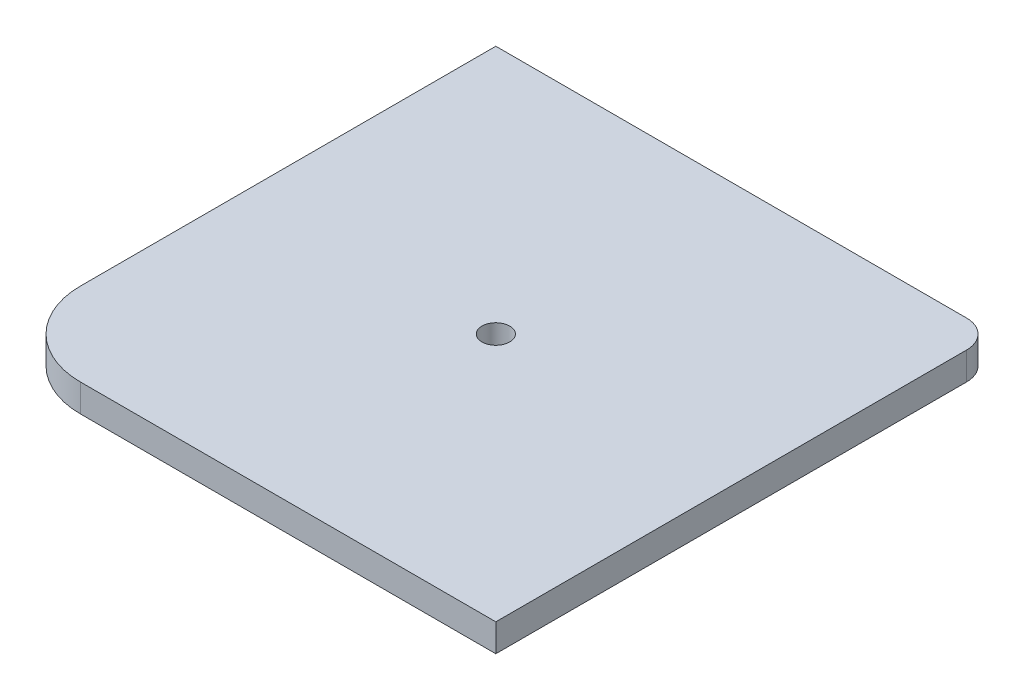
ISO-10303-21;
HEADER;
FILE_DESCRIPTION(('STEP AP214'),'2;1');
FILE_NAME('part.step','',(''),(''),'','','');
FILE_SCHEMA(('AUTOMOTIVE_DESIGN { 1 0 10303 214 1 1 1 1 }'));
ENDSEC;
DATA;
#1=APPLICATION_CONTEXT('core data for automotive mechanical design processes');
#2=APPLICATION_PROTOCOL_DEFINITION('international standard','automotive_design',2000,#1);
#3=PRODUCT_CONTEXT('',#1,'mechanical');
#4=PRODUCT('Part','Part','',(#3));
#5=PRODUCT_RELATED_PRODUCT_CATEGORY('part','',(#4));
#6=PRODUCT_DEFINITION_FORMATION('','',#4);
#7=PRODUCT_DEFINITION_CONTEXT('part definition',#1,'design');
#8=PRODUCT_DEFINITION('design','',#6,#7);
#9=PRODUCT_DEFINITION_SHAPE('','',#8);
#10=(LENGTH_UNIT() NAMED_UNIT(*) SI_UNIT(.MILLI.,.METRE.));
#11=(NAMED_UNIT(*) PLANE_ANGLE_UNIT() SI_UNIT($,.RADIAN.));
#12=(NAMED_UNIT(*) SI_UNIT($,.STERADIAN.) SOLID_ANGLE_UNIT());
#13=UNCERTAINTY_MEASURE_WITH_UNIT(LENGTH_MEASURE(1.E-05),#10,'distance_accuracy_value','');
#14=(GEOMETRIC_REPRESENTATION_CONTEXT(3) GLOBAL_UNCERTAINTY_ASSIGNED_CONTEXT((#13)) GLOBAL_UNIT_ASSIGNED_CONTEXT((#10,
#11,#12)) REPRESENTATION_CONTEXT('',''));
#15=CARTESIAN_POINT('',(0.,0.,0.));
#16=DIRECTION('',(0.,0.,1.));
#17=DIRECTION('',(1.,0.,0.));
#18=AXIS2_PLACEMENT_3D('',#15,#16,#17);
#19=CARTESIAN_POINT('',(85.,5.,-85.));
#20=DIRECTION('',(0.,1.,0.));
#21=DIRECTION('',(0.,0.,1.));
#22=AXIS2_PLACEMENT_3D('',#19,#20,#21);
#23=PLANE('',#22);
#24=DIRECTION('',(-1.,0.,0.));
#25=VECTOR('',#24,1.);
#26=CARTESIAN_POINT('',(0.,5.,-90.));
#27=LINE('',#26,#25);
#28=CARTESIAN_POINT('',(85.,5.,-90.));
#29=VERTEX_POINT('',#28);
#30=CARTESIAN_POINT('',(0.,5.,-90.));
#31=VERTEX_POINT('',#30);
#32=EDGE_CURVE('E118',#29,#31,#27,.T.);
#33=ORIENTED_EDGE('',*,*,#32,.T.);
#34=DIRECTION('',(0.,0.,1.));
#35=VECTOR('',#34,1.);
#36=CARTESIAN_POINT('',(0.,5.,-15.0000000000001));
#37=LINE('',#36,#35);
#38=CARTESIAN_POINT('',(0.,5.,-15.0000000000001));
#39=VERTEX_POINT('',#38);
#40=EDGE_CURVE('E99',#31,#39,#37,.T.);
#41=ORIENTED_EDGE('',*,*,#40,.T.);
#42=CARTESIAN_POINT('',(15.,5.,-15.));
#43=DIRECTION('',(0.,1.,0.));
#44=DIRECTION('',(0.,0.,-1.));
#45=AXIS2_PLACEMENT_3D('',#42,#43,#44);
#46=CIRCLE('',#45,15.);
#47=CARTESIAN_POINT('',(15.0000000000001,5.,0.));
#48=VERTEX_POINT('',#47);
#49=EDGE_CURVE('E121',#39,#48,#46,.T.);
#50=ORIENTED_EDGE('',*,*,#49,.T.);
#51=DIRECTION('',(1.,0.,0.));
#52=VECTOR('',#51,1.);
#53=CARTESIAN_POINT('',(15.0000000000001,5.,0.));
#54=LINE('',#53,#52);
#55=CARTESIAN_POINT('',(90.,5.,0.));
#56=VERTEX_POINT('',#55);
#57=EDGE_CURVE('E123',#48,#56,#54,.T.);
#58=ORIENTED_EDGE('',*,*,#57,.T.);
#59=DIRECTION('',(0.,0.,-1.));
#60=VECTOR('',#59,1.);
#61=CARTESIAN_POINT('',(90.,5.,0.));
#62=LINE('',#61,#60);
#63=CARTESIAN_POINT('',(90.,5.,-85.));
#64=VERTEX_POINT('',#63);
#65=EDGE_CURVE('E52',#56,#64,#62,.T.);
#66=ORIENTED_EDGE('',*,*,#65,.T.);
#67=CARTESIAN_POINT('',(85.,5.,-85.));
#68=DIRECTION('',(0.,1.,0.));
#69=DIRECTION('',(0.,0.,1.));
#70=AXIS2_PLACEMENT_3D('',#67,#68,#69);
#71=CIRCLE('',#70,5.);
#72=EDGE_CURVE('E47',#64,#29,#71,.T.);
#73=ORIENTED_EDGE('',*,*,#72,.T.);
#74=EDGE_LOOP('',(#33,#41,#50,#58,#66,#73));
#75=FACE_BOUND('',#74,.T.);
#76=CARTESIAN_POINT('',(45.,5.,-45.));
#77=DIRECTION('',(0.,1.,0.));
#78=DIRECTION('',(0.,0.,1.));
#79=AXIS2_PLACEMENT_3D('',#76,#77,#78);
#80=CIRCLE('',#79,2.5);
#81=CARTESIAN_POINT('',(45.,5.,-42.5));
#82=VERTEX_POINT('',#81);
#83=EDGE_CURVE('E104',#82,#82,#80,.T.);
#84=ORIENTED_EDGE('',*,*,#83,.F.);
#85=EDGE_LOOP('',(#84));
#86=FACE_BOUND('',#85,.T.);
#87=ADVANCED_FACE('F32',(#75,#86),#23,.T.);
#88=CARTESIAN_POINT('',(85.,0.,-85.));
#89=DIRECTION('',(0.,1.,0.));
#90=DIRECTION('',(0.,0.,1.));
#91=AXIS2_PLACEMENT_3D('',#88,#89,#90);
#92=PLANE('',#91);
#93=DIRECTION('',(-1.,0.,0.));
#94=VECTOR('',#93,1.);
#95=CARTESIAN_POINT('',(0.,0.,-90.));
#96=LINE('',#95,#94);
#97=CARTESIAN_POINT('',(85.,0.,-90.));
#98=VERTEX_POINT('',#97);
#99=CARTESIAN_POINT('',(0.,0.,-90.));
#100=VERTEX_POINT('',#99);
#101=EDGE_CURVE('E90',#98,#100,#96,.T.);
#102=ORIENTED_EDGE('',*,*,#101,.F.);
#103=CARTESIAN_POINT('',(85.,0.,-85.));
#104=DIRECTION('',(0.,1.,0.));
#105=DIRECTION('',(0.,0.,1.));
#106=AXIS2_PLACEMENT_3D('',#103,#104,#105);
#107=CIRCLE('',#106,5.);
#108=CARTESIAN_POINT('',(90.,0.,-85.));
#109=VERTEX_POINT('',#108);
#110=EDGE_CURVE('E116',#109,#98,#107,.T.);
#111=ORIENTED_EDGE('',*,*,#110,.F.);
#112=DIRECTION('',(0.,0.,-1.));
#113=VECTOR('',#112,1.);
#114=CARTESIAN_POINT('',(90.,0.,0.));
#115=LINE('',#114,#113);
#116=CARTESIAN_POINT('',(90.,0.,0.));
#117=VERTEX_POINT('',#116);
#118=EDGE_CURVE('E114',#117,#109,#115,.T.);
#119=ORIENTED_EDGE('',*,*,#118,.F.);
#120=DIRECTION('',(1.,0.,0.));
#121=VECTOR('',#120,1.);
#122=CARTESIAN_POINT('',(15.0000000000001,0.,0.));
#123=LINE('',#122,#121);
#124=CARTESIAN_POINT('',(15.0000000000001,0.,0.));
#125=VERTEX_POINT('',#124);
#126=EDGE_CURVE('E112',#125,#117,#123,.T.);
#127=ORIENTED_EDGE('',*,*,#126,.F.);
#128=CARTESIAN_POINT('',(15.,0.,-15.));
#129=DIRECTION('',(0.,1.,0.));
#130=DIRECTION('',(0.,0.,-1.));
#131=AXIS2_PLACEMENT_3D('',#128,#129,#130);
#132=CIRCLE('',#131,15.);
#133=CARTESIAN_POINT('',(0.,0.,-15.0000000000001));
#134=VERTEX_POINT('',#133);
#135=EDGE_CURVE('E92',#134,#125,#132,.T.);
#136=ORIENTED_EDGE('',*,*,#135,.F.);
#137=DIRECTION('',(0.,0.,1.));
#138=VECTOR('',#137,1.);
#139=CARTESIAN_POINT('',(0.,0.,-15.0000000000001));
#140=LINE('',#139,#138);
#141=EDGE_CURVE('E85',#100,#134,#140,.T.);
#142=ORIENTED_EDGE('',*,*,#141,.F.);
#143=EDGE_LOOP('',(#102,#111,#119,#127,#136,#142));
#144=FACE_BOUND('',#143,.T.);
#145=CARTESIAN_POINT('',(45.,0.,-45.));
#146=DIRECTION('',(0.,1.,0.));
#147=DIRECTION('',(0.,0.,1.));
#148=AXIS2_PLACEMENT_3D('',#145,#146,#147);
#149=CIRCLE('',#148,2.5);
#150=CARTESIAN_POINT('',(45.,0.,-42.5));
#151=VERTEX_POINT('',#150);
#152=EDGE_CURVE('E107',#151,#151,#149,.T.);
#153=ORIENTED_EDGE('',*,*,#152,.T.);
#154=EDGE_LOOP('',(#153));
#155=FACE_BOUND('',#154,.T.);
#156=ADVANCED_FACE('F86',(#144,#155),#92,.F.);
#157=CARTESIAN_POINT('',(0.,5.,-90.));
#158=DIRECTION('',(0.,0.,1.));
#159=DIRECTION('',(1.,0.,0.));
#160=AXIS2_PLACEMENT_3D('',#157,#158,#159);
#161=PLANE('',#160);
#162=ORIENTED_EDGE('',*,*,#101,.T.);
#163=DIRECTION('',(0.,-1.,0.));
#164=VECTOR('',#163,1.);
#165=CARTESIAN_POINT('',(0.,5.,-90.));
#166=LINE('',#165,#164);
#167=EDGE_CURVE('E11',#31,#100,#166,.T.);
#168=ORIENTED_EDGE('',*,*,#167,.F.);
#169=ORIENTED_EDGE('',*,*,#32,.F.);
#170=DIRECTION('',(0.,-1.,0.));
#171=VECTOR('',#170,1.);
#172=CARTESIAN_POINT('',(85.,5.,-90.));
#173=LINE('',#172,#171);
#174=EDGE_CURVE('E103',#29,#98,#173,.T.);
#175=ORIENTED_EDGE('',*,*,#174,.T.);
#176=EDGE_LOOP('',(#162,#168,#169,#175));
#177=FACE_BOUND('',#176,.T.);
#178=ADVANCED_FACE('F34',(#177),#161,.F.);
#179=CARTESIAN_POINT('',(0.,5.,-15.0000000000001));
#180=DIRECTION('',(1.,0.,0.));
#181=DIRECTION('',(0.,0.,-1.));
#182=AXIS2_PLACEMENT_3D('',#179,#180,#181);
#183=PLANE('',#182);
#184=ORIENTED_EDGE('',*,*,#141,.T.);
#185=DIRECTION('',(0.,-1.,0.));
#186=VECTOR('',#185,1.);
#187=CARTESIAN_POINT('',(0.,5.,-15.0000000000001));
#188=LINE('',#187,#186);
#189=EDGE_CURVE('E40',#39,#134,#188,.T.);
#190=ORIENTED_EDGE('',*,*,#189,.F.);
#191=ORIENTED_EDGE('',*,*,#40,.F.);
#192=ORIENTED_EDGE('',*,*,#167,.T.);
#193=EDGE_LOOP('',(#184,#190,#191,#192));
#194=FACE_BOUND('',#193,.T.);
#195=ADVANCED_FACE('F98',(#194),#183,.F.);
#196=CARTESIAN_POINT('',(15.,5.,-15.));
#197=DIRECTION('',(0.,-1.,0.));
#198=DIRECTION('',(0.,0.,-1.));
#199=AXIS2_PLACEMENT_3D('',#196,#197,#198);
#200=CYLINDRICAL_SURFACE('',#199,15.);
#201=ORIENTED_EDGE('',*,*,#135,.T.);
#202=DIRECTION('',(0.,-1.,0.));
#203=VECTOR('',#202,1.);
#204=CARTESIAN_POINT('',(15.0000000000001,5.,0.));
#205=LINE('',#204,#203);
#206=EDGE_CURVE('E134',#48,#125,#205,.T.);
#207=ORIENTED_EDGE('',*,*,#206,.F.);
#208=ORIENTED_EDGE('',*,*,#49,.F.);
#209=ORIENTED_EDGE('',*,*,#189,.T.);
#210=EDGE_LOOP('',(#201,#207,#208,#209));
#211=FACE_BOUND('',#210,.T.);
#212=ADVANCED_FACE('F138',(#211),#200,.T.);
#213=CARTESIAN_POINT('',(15.0000000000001,5.,0.));
#214=DIRECTION('',(0.,0.,-1.));
#215=DIRECTION('',(-1.,0.,0.));
#216=AXIS2_PLACEMENT_3D('',#213,#214,#215);
#217=PLANE('',#216);
#218=ORIENTED_EDGE('',*,*,#126,.T.);
#219=DIRECTION('',(0.,-1.,0.));
#220=VECTOR('',#219,1.);
#221=CARTESIAN_POINT('',(90.,5.,0.));
#222=LINE('',#221,#220);
#223=EDGE_CURVE('E131',#56,#117,#222,.T.);
#224=ORIENTED_EDGE('',*,*,#223,.F.);
#225=ORIENTED_EDGE('',*,*,#57,.F.);
#226=ORIENTED_EDGE('',*,*,#206,.T.);
#227=EDGE_LOOP('',(#218,#224,#225,#226));
#228=FACE_BOUND('',#227,.T.);
#229=ADVANCED_FACE('F144',(#228),#217,.F.);
#230=CARTESIAN_POINT('',(90.,5.,0.));
#231=DIRECTION('',(-1.,0.,0.));
#232=DIRECTION('',(0.,0.,1.));
#233=AXIS2_PLACEMENT_3D('',#230,#231,#232);
#234=PLANE('',#233);
#235=ORIENTED_EDGE('',*,*,#118,.T.);
#236=DIRECTION('',(0.,-1.,0.));
#237=VECTOR('',#236,1.);
#238=CARTESIAN_POINT('',(90.,5.,-85.));
#239=LINE('',#238,#237);
#240=EDGE_CURVE('E128',#64,#109,#239,.T.);
#241=ORIENTED_EDGE('',*,*,#240,.F.);
#242=ORIENTED_EDGE('',*,*,#65,.F.);
#243=ORIENTED_EDGE('',*,*,#223,.T.);
#244=EDGE_LOOP('',(#235,#241,#242,#243));
#245=FACE_BOUND('',#244,.T.);
#246=ADVANCED_FACE('F147',(#245),#234,.F.);
#247=CARTESIAN_POINT('',(85.,5.,-85.));
#248=DIRECTION('',(0.,-1.,0.));
#249=DIRECTION('',(0.,0.,-1.));
#250=AXIS2_PLACEMENT_3D('',#247,#248,#249);
#251=CYLINDRICAL_SURFACE('',#250,5.);
#252=ORIENTED_EDGE('',*,*,#110,.T.);
#253=ORIENTED_EDGE('',*,*,#174,.F.);
#254=ORIENTED_EDGE('',*,*,#72,.F.);
#255=ORIENTED_EDGE('',*,*,#240,.T.);
#256=EDGE_LOOP('',(#252,#253,#254,#255));
#257=FACE_BOUND('',#256,.T.);
#258=ADVANCED_FACE('F149',(#257),#251,.T.);
#259=CARTESIAN_POINT('',(45.,5.,-45.));
#260=DIRECTION('',(0.,-1.,0.));
#261=DIRECTION('',(0.,0.,-1.));
#262=AXIS2_PLACEMENT_3D('',#259,#260,#261);
#263=CYLINDRICAL_SURFACE('',#262,2.5);
#264=ORIENTED_EDGE('',*,*,#83,.T.);
#265=EDGE_LOOP('',(#264));
#266=FACE_BOUND('',#265,.T.);
#267=ORIENTED_EDGE('',*,*,#152,.F.);
#268=EDGE_LOOP('',(#267));
#269=FACE_BOUND('',#268,.T.);
#270=ADVANCED_FACE('F151',(#266,#269),#263,.F.);
#271=CLOSED_SHELL('',(#87,#156,#178,#195,#212,#229,#246,#258,#270));
#272=MANIFOLD_SOLID_BREP('B2',#271);
#273=ADVANCED_BREP_SHAPE_REPRESENTATION('',(#18,#272),#14);
#274=SHAPE_DEFINITION_REPRESENTATION(#9,#273);
ENDSEC;
END-ISO-10303-21;
